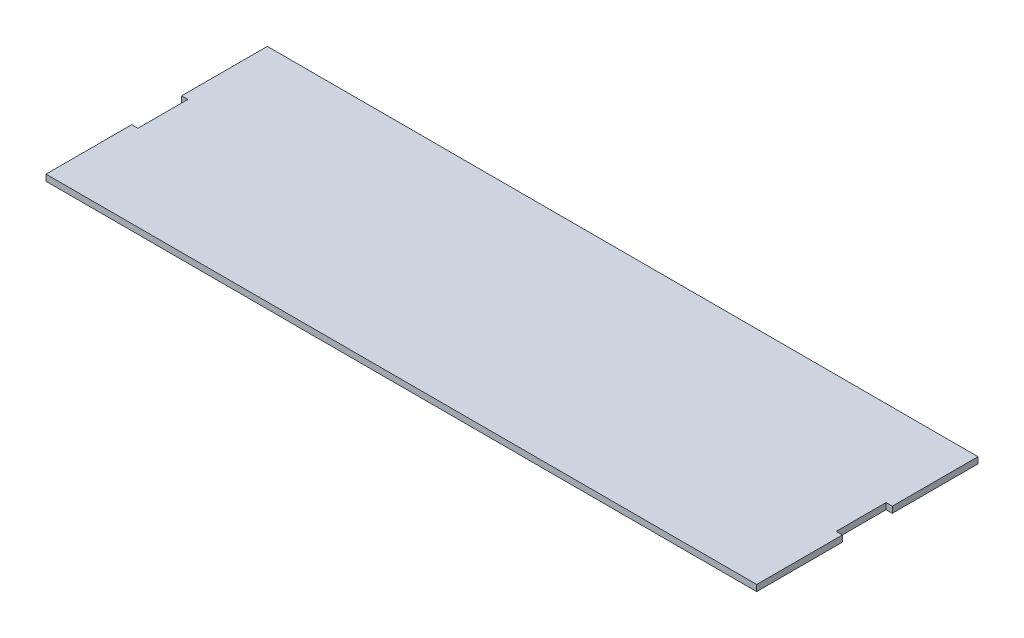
ISO-10303-21;
HEADER;
FILE_DESCRIPTION(('STEP AP214'),'2;1');
FILE_NAME('part.step','',(''),(''),'','','');
FILE_SCHEMA(('AUTOMOTIVE_DESIGN { 1 0 10303 214 1 1 1 1 }'));
ENDSEC;
DATA;
#1=APPLICATION_CONTEXT('core data for automotive mechanical design processes');
#2=APPLICATION_PROTOCOL_DEFINITION('international standard','automotive_design',2000,#1);
#3=PRODUCT_CONTEXT('',#1,'mechanical');
#4=PRODUCT('Part','Part','',(#3));
#5=PRODUCT_RELATED_PRODUCT_CATEGORY('part','',(#4));
#6=PRODUCT_DEFINITION_FORMATION('','',#4);
#7=PRODUCT_DEFINITION_CONTEXT('part definition',#1,'design');
#8=PRODUCT_DEFINITION('design','',#6,#7);
#9=PRODUCT_DEFINITION_SHAPE('','',#8);
#10=(LENGTH_UNIT() NAMED_UNIT(*) SI_UNIT(.MILLI.,.METRE.));
#11=(NAMED_UNIT(*) PLANE_ANGLE_UNIT() SI_UNIT($,.RADIAN.));
#12=(NAMED_UNIT(*) SI_UNIT($,.STERADIAN.) SOLID_ANGLE_UNIT());
#13=UNCERTAINTY_MEASURE_WITH_UNIT(LENGTH_MEASURE(1.E-05),#10,'distance_accuracy_value','');
#14=(GEOMETRIC_REPRESENTATION_CONTEXT(3) GLOBAL_UNCERTAINTY_ASSIGNED_CONTEXT((#13)) GLOBAL_UNIT_ASSIGNED_CONTEXT((#10,
#11,#12)) REPRESENTATION_CONTEXT('',''));
#15=CARTESIAN_POINT('',(0.,0.,0.));
#16=DIRECTION('',(0.,0.,1.));
#17=DIRECTION('',(1.,0.,0.));
#18=AXIS2_PLACEMENT_3D('',#15,#16,#17);
#19=CARTESIAN_POINT('',(-114.,2.,-35.5));
#20=DIRECTION('',(1.,0.,0.));
#21=DIRECTION('',(0.,0.,-1.));
#22=AXIS2_PLACEMENT_3D('',#19,#20,#21);
#23=PLANE('',#22);
#24=DIRECTION('',(0.,0.,1.));
#25=VECTOR('',#24,1.);
#26=CARTESIAN_POINT('',(-114.,2.,-35.5));
#27=LINE('',#26,#25);
#28=CARTESIAN_POINT('',(-114.,2.,8.));
#29=VERTEX_POINT('',#28);
#30=CARTESIAN_POINT('',(-114.,2.,35.5));
#31=VERTEX_POINT('',#30);
#32=EDGE_CURVE('E188',#29,#31,#27,.T.);
#33=ORIENTED_EDGE('',*,*,#32,.F.);
#34=DIRECTION('',(0.,-1.,0.));
#35=VECTOR('',#34,1.);
#36=CARTESIAN_POINT('',(-114.,2.,8.));
#37=LINE('',#36,#35);
#38=CARTESIAN_POINT('',(-114.,0.,8.));
#39=VERTEX_POINT('',#38);
#40=EDGE_CURVE('E152',#29,#39,#37,.T.);
#41=ORIENTED_EDGE('',*,*,#40,.T.);
#42=DIRECTION('',(0.,0.,1.));
#43=VECTOR('',#42,1.);
#44=CARTESIAN_POINT('',(-114.,0.,-35.5));
#45=LINE('',#44,#43);
#46=CARTESIAN_POINT('',(-114.,0.,35.5));
#47=VERTEX_POINT('',#46);
#48=EDGE_CURVE('E176',#39,#47,#45,.T.);
#49=ORIENTED_EDGE('',*,*,#48,.T.);
#50=DIRECTION('',(0.,-1.,0.));
#51=VECTOR('',#50,1.);
#52=CARTESIAN_POINT('',(-114.,2.,35.5));
#53=LINE('',#52,#51);
#54=EDGE_CURVE('E207',#31,#47,#53,.T.);
#55=ORIENTED_EDGE('',*,*,#54,.F.);
#56=EDGE_LOOP('',(#33,#41,#49,#55));
#57=FACE_BOUND('',#56,.T.);
#58=ADVANCED_FACE('F33',(#57),#23,.F.);
#59=CARTESIAN_POINT('',(114.,2.,-35.5));
#60=DIRECTION('',(-1.,0.,0.));
#61=DIRECTION('',(0.,0.,1.));
#62=AXIS2_PLACEMENT_3D('',#59,#60,#61);
#63=PLANE('',#62);
#64=DIRECTION('',(0.,0.,-1.));
#65=VECTOR('',#64,1.);
#66=CARTESIAN_POINT('',(114.,0.,-35.5));
#67=LINE('',#66,#65);
#68=CARTESIAN_POINT('',(114.,0.,35.5));
#69=VERTEX_POINT('',#68);
#70=CARTESIAN_POINT('',(114.,0.,8.));
#71=VERTEX_POINT('',#70);
#72=EDGE_CURVE('E183',#69,#71,#67,.T.);
#73=ORIENTED_EDGE('',*,*,#72,.T.);
#74=DIRECTION('',(0.,1.,0.));
#75=VECTOR('',#74,1.);
#76=CARTESIAN_POINT('',(114.,2.,8.));
#77=LINE('',#76,#75);
#78=CARTESIAN_POINT('',(114.,2.,8.));
#79=VERTEX_POINT('',#78);
#80=EDGE_CURVE('E173',#71,#79,#77,.T.);
#81=ORIENTED_EDGE('',*,*,#80,.T.);
#82=DIRECTION('',(0.,0.,-1.));
#83=VECTOR('',#82,1.);
#84=CARTESIAN_POINT('',(114.,2.,-35.5));
#85=LINE('',#84,#83);
#86=CARTESIAN_POINT('',(114.,2.,35.5));
#87=VERTEX_POINT('',#86);
#88=EDGE_CURVE('E193',#87,#79,#85,.T.);
#89=ORIENTED_EDGE('',*,*,#88,.F.);
#90=DIRECTION('',(0.,-1.,0.));
#91=VECTOR('',#90,1.);
#92=CARTESIAN_POINT('',(114.,2.,35.5));
#93=LINE('',#92,#91);
#94=EDGE_CURVE('E204',#87,#69,#93,.T.);
#95=ORIENTED_EDGE('',*,*,#94,.T.);
#96=EDGE_LOOP('',(#73,#81,#89,#95));
#97=FACE_BOUND('',#96,.T.);
#98=ADVANCED_FACE('F232',(#97),#63,.F.);
#99=CARTESIAN_POINT('',(-114.,0.,-35.5));
#100=VERTEX_POINT('',#99);
#101=CARTESIAN_POINT('',(-114.,0.,-8.));
#102=VERTEX_POINT('',#101);
#103=EDGE_CURVE('E177',#100,#102,#45,.T.);
#104=ORIENTED_EDGE('',*,*,#103,.T.);
#105=DIRECTION('',(0.,1.,0.));
#106=VECTOR('',#105,1.);
#107=CARTESIAN_POINT('',(-114.,2.,-8.));
#108=LINE('',#107,#106);
#109=CARTESIAN_POINT('',(-114.,2.,-8.));
#110=VERTEX_POINT('',#109);
#111=EDGE_CURVE('E48',#102,#110,#108,.T.);
#112=ORIENTED_EDGE('',*,*,#111,.T.);
#113=CARTESIAN_POINT('',(-114.,2.,-35.5));
#114=VERTEX_POINT('',#113);
#115=EDGE_CURVE('E142',#114,#110,#27,.T.);
#116=ORIENTED_EDGE('',*,*,#115,.F.);
#117=DIRECTION('',(0.,-1.,0.));
#118=VECTOR('',#117,1.);
#119=CARTESIAN_POINT('',(-114.,2.,-35.5));
#120=LINE('',#119,#118);
#121=EDGE_CURVE('E198',#114,#100,#120,.T.);
#122=ORIENTED_EDGE('',*,*,#121,.T.);
#123=EDGE_LOOP('',(#104,#112,#116,#122));
#124=FACE_BOUND('',#123,.T.);
#125=ADVANCED_FACE('F35',(#124),#23,.F.);
#126=CARTESIAN_POINT('',(-114.,2.,35.5));
#127=DIRECTION('',(0.,0.,-1.));
#128=DIRECTION('',(-1.,0.,0.));
#129=AXIS2_PLACEMENT_3D('',#126,#127,#128);
#130=PLANE('',#129);
#131=DIRECTION('',(1.,0.,0.));
#132=VECTOR('',#131,1.);
#133=CARTESIAN_POINT('',(-114.,0.,35.5));
#134=LINE('',#133,#132);
#135=EDGE_CURVE('E180',#47,#69,#134,.T.);
#136=ORIENTED_EDGE('',*,*,#135,.T.);
#137=ORIENTED_EDGE('',*,*,#94,.F.);
#138=DIRECTION('',(1.,0.,0.));
#139=VECTOR('',#138,1.);
#140=CARTESIAN_POINT('',(-114.,2.,35.5));
#141=LINE('',#140,#139);
#142=EDGE_CURVE('E190',#31,#87,#141,.T.);
#143=ORIENTED_EDGE('',*,*,#142,.F.);
#144=ORIENTED_EDGE('',*,*,#54,.T.);
#145=EDGE_LOOP('',(#136,#137,#143,#144));
#146=FACE_BOUND('',#145,.T.);
#147=ADVANCED_FACE('F239',(#146),#130,.F.);
#148=CARTESIAN_POINT('',(114.,2.,-8.));
#149=VERTEX_POINT('',#148);
#150=CARTESIAN_POINT('',(114.,2.,-35.5));
#151=VERTEX_POINT('',#150);
#152=EDGE_CURVE('E192',#149,#151,#85,.T.);
#153=ORIENTED_EDGE('',*,*,#152,.F.);
#154=DIRECTION('',(0.,-1.,0.));
#155=VECTOR('',#154,1.);
#156=CARTESIAN_POINT('',(114.,2.,-8.));
#157=LINE('',#156,#155);
#158=CARTESIAN_POINT('',(114.,0.,-8.));
#159=VERTEX_POINT('',#158);
#160=EDGE_CURVE('E169',#149,#159,#157,.T.);
#161=ORIENTED_EDGE('',*,*,#160,.T.);
#162=CARTESIAN_POINT('',(114.,0.,-35.5));
#163=VERTEX_POINT('',#162);
#164=EDGE_CURVE('E182',#159,#163,#67,.T.);
#165=ORIENTED_EDGE('',*,*,#164,.T.);
#166=DIRECTION('',(0.,-1.,0.));
#167=VECTOR('',#166,1.);
#168=CARTESIAN_POINT('',(114.,2.,-35.5));
#169=LINE('',#168,#167);
#170=EDGE_CURVE('E201',#151,#163,#169,.T.);
#171=ORIENTED_EDGE('',*,*,#170,.F.);
#172=EDGE_LOOP('',(#153,#161,#165,#171));
#173=FACE_BOUND('',#172,.T.);
#174=ADVANCED_FACE('F220',(#173),#63,.F.);
#175=CARTESIAN_POINT('',(-114.,2.,-35.5));
#176=DIRECTION('',(0.,0.,1.));
#177=DIRECTION('',(1.,0.,0.));
#178=AXIS2_PLACEMENT_3D('',#175,#176,#177);
#179=PLANE('',#178);
#180=DIRECTION('',(-1.,0.,0.));
#181=VECTOR('',#180,1.);
#182=CARTESIAN_POINT('',(-114.,0.,-35.5));
#183=LINE('',#182,#181);
#184=EDGE_CURVE('E186',#163,#100,#183,.T.);
#185=ORIENTED_EDGE('',*,*,#184,.T.);
#186=ORIENTED_EDGE('',*,*,#121,.F.);
#187=DIRECTION('',(-1.,0.,0.));
#188=VECTOR('',#187,1.);
#189=CARTESIAN_POINT('',(-114.,2.,-35.5));
#190=LINE('',#189,#188);
#191=EDGE_CURVE('E196',#151,#114,#190,.T.);
#192=ORIENTED_EDGE('',*,*,#191,.F.);
#193=ORIENTED_EDGE('',*,*,#170,.T.);
#194=EDGE_LOOP('',(#185,#186,#192,#193));
#195=FACE_BOUND('',#194,.T.);
#196=ADVANCED_FACE('F247',(#195),#179,.F.);
#197=CARTESIAN_POINT('',(-114.,2.,35.5));
#198=DIRECTION('',(0.,1.,0.));
#199=DIRECTION('',(0.,0.,1.));
#200=AXIS2_PLACEMENT_3D('',#197,#198,#199);
#201=PLANE('',#200);
#202=DIRECTION('',(1.,0.,0.));
#203=VECTOR('',#202,1.);
#204=CARTESIAN_POINT('',(-112.,2.,8.));
#205=LINE('',#204,#203);
#206=CARTESIAN_POINT('',(-112.,2.,8.));
#207=VERTEX_POINT('',#206);
#208=EDGE_CURVE('E143',#29,#207,#205,.T.);
#209=ORIENTED_EDGE('',*,*,#208,.F.);
#210=ORIENTED_EDGE('',*,*,#32,.T.);
#211=ORIENTED_EDGE('',*,*,#142,.T.);
#212=ORIENTED_EDGE('',*,*,#88,.T.);
#213=DIRECTION('',(1.,0.,0.));
#214=VECTOR('',#213,1.);
#215=CARTESIAN_POINT('',(123.02396514,2.,8.));
#216=LINE('',#215,#214);
#217=CARTESIAN_POINT('',(112.,2.,8.));
#218=VERTEX_POINT('',#217);
#219=EDGE_CURVE('E160',#218,#79,#216,.T.);
#220=ORIENTED_EDGE('',*,*,#219,.F.);
#221=DIRECTION('',(0.,0.,1.));
#222=VECTOR('',#221,1.);
#223=CARTESIAN_POINT('',(112.,2.,-8.));
#224=LINE('',#223,#222);
#225=CARTESIAN_POINT('',(112.,2.,-8.));
#226=VERTEX_POINT('',#225);
#227=EDGE_CURVE('E157',#226,#218,#224,.T.);
#228=ORIENTED_EDGE('',*,*,#227,.F.);
#229=DIRECTION('',(-1.,0.,0.));
#230=VECTOR('',#229,1.);
#231=CARTESIAN_POINT('',(123.02396514,2.,-8.));
#232=LINE('',#231,#230);
#233=EDGE_CURVE('E155',#149,#226,#232,.T.);
#234=ORIENTED_EDGE('',*,*,#233,.F.);
#235=ORIENTED_EDGE('',*,*,#152,.T.);
#236=ORIENTED_EDGE('',*,*,#191,.T.);
#237=ORIENTED_EDGE('',*,*,#115,.T.);
#238=DIRECTION('',(-1.,0.,0.));
#239=VECTOR('',#238,1.);
#240=CARTESIAN_POINT('',(-112.,2.,-8.));
#241=LINE('',#240,#239);
#242=CARTESIAN_POINT('',(-112.,2.,-8.));
#243=VERTEX_POINT('',#242);
#244=EDGE_CURVE('E125',#243,#110,#241,.T.);
#245=ORIENTED_EDGE('',*,*,#244,.F.);
#246=DIRECTION('',(0.,0.,-1.));
#247=VECTOR('',#246,1.);
#248=CARTESIAN_POINT('',(-112.,2.,-8.));
#249=LINE('',#248,#247);
#250=EDGE_CURVE('E134',#207,#243,#249,.T.);
#251=ORIENTED_EDGE('',*,*,#250,.F.);
#252=EDGE_LOOP('',(#209,#210,#211,#212,#220,#228,#234,#235,#236,#237,#245,#251));
#253=FACE_BOUND('',#252,.T.);
#254=ADVANCED_FACE('F140',(#253),#201,.T.);
#255=CARTESIAN_POINT('',(-114.,0.,35.5));
#256=DIRECTION('',(0.,1.,0.));
#257=DIRECTION('',(0.,0.,1.));
#258=AXIS2_PLACEMENT_3D('',#255,#256,#257);
#259=PLANE('',#258);
#260=ORIENTED_EDGE('',*,*,#48,.F.);
#261=DIRECTION('',(1.,0.,0.));
#262=VECTOR('',#261,1.);
#263=CARTESIAN_POINT('',(-114.,0.,8.));
#264=LINE('',#263,#262);
#265=CARTESIAN_POINT('',(-112.,0.,8.));
#266=VERTEX_POINT('',#265);
#267=EDGE_CURVE('E11',#39,#266,#264,.T.);
#268=ORIENTED_EDGE('',*,*,#267,.T.);
#269=DIRECTION('',(0.,0.,-1.));
#270=VECTOR('',#269,1.);
#271=CARTESIAN_POINT('',(-112.,0.,-8.));
#272=LINE('',#271,#270);
#273=CARTESIAN_POINT('',(-112.,0.,-8.));
#274=VERTEX_POINT('',#273);
#275=EDGE_CURVE('E145',#266,#274,#272,.T.);
#276=ORIENTED_EDGE('',*,*,#275,.T.);
#277=DIRECTION('',(-1.,0.,0.));
#278=VECTOR('',#277,1.);
#279=CARTESIAN_POINT('',(-112.,0.,-8.));
#280=LINE('',#279,#278);
#281=EDGE_CURVE('E126',#274,#102,#280,.T.);
#282=ORIENTED_EDGE('',*,*,#281,.T.);
#283=ORIENTED_EDGE('',*,*,#103,.F.);
#284=ORIENTED_EDGE('',*,*,#184,.F.);
#285=ORIENTED_EDGE('',*,*,#164,.F.);
#286=DIRECTION('',(-1.,0.,0.));
#287=VECTOR('',#286,1.);
#288=CARTESIAN_POINT('',(-114.,0.,-8.));
#289=LINE('',#288,#287);
#290=CARTESIAN_POINT('',(112.,0.,-8.));
#291=VERTEX_POINT('',#290);
#292=EDGE_CURVE('E41',#159,#291,#289,.T.);
#293=ORIENTED_EDGE('',*,*,#292,.T.);
#294=DIRECTION('',(0.,0.,1.));
#295=VECTOR('',#294,1.);
#296=CARTESIAN_POINT('',(112.,0.,-8.));
#297=LINE('',#296,#295);
#298=CARTESIAN_POINT('',(112.,0.,8.));
#299=VERTEX_POINT('',#298);
#300=EDGE_CURVE('E56',#291,#299,#297,.T.);
#301=ORIENTED_EDGE('',*,*,#300,.T.);
#302=DIRECTION('',(1.,0.,0.));
#303=VECTOR('',#302,1.);
#304=CARTESIAN_POINT('',(123.02396514,0.,8.));
#305=LINE('',#304,#303);
#306=EDGE_CURVE('E163',#299,#71,#305,.T.);
#307=ORIENTED_EDGE('',*,*,#306,.T.);
#308=ORIENTED_EDGE('',*,*,#72,.F.);
#309=ORIENTED_EDGE('',*,*,#135,.F.);
#310=EDGE_LOOP('',(#260,#268,#276,#282,#283,#284,#285,#293,#301,#307,#308,#309));
#311=FACE_BOUND('',#310,.T.);
#312=ADVANCED_FACE('F213',(#311),#259,.F.);
#313=CARTESIAN_POINT('',(123.02396514,0.,8.));
#314=DIRECTION('',(0.,0.,1.));
#315=DIRECTION('',(1.,0.,0.));
#316=AXIS2_PLACEMENT_3D('',#313,#314,#315);
#317=PLANE('',#316);
#318=ORIENTED_EDGE('',*,*,#306,.F.);
#319=DIRECTION('',(0.,1.,0.));
#320=VECTOR('',#319,1.);
#321=CARTESIAN_POINT('',(112.,0.,8.));
#322=LINE('',#321,#320);
#323=EDGE_CURVE('E167',#299,#218,#322,.T.);
#324=ORIENTED_EDGE('',*,*,#323,.T.);
#325=ORIENTED_EDGE('',*,*,#219,.T.);
#326=ORIENTED_EDGE('',*,*,#80,.F.);
#327=EDGE_LOOP('',(#318,#324,#325,#326));
#328=FACE_BOUND('',#327,.T.);
#329=ADVANCED_FACE('F230',(#328),#317,.F.);
#330=CARTESIAN_POINT('',(123.02396514,0.,-8.));
#331=DIRECTION('',(0.,0.,-1.));
#332=DIRECTION('',(-1.,0.,0.));
#333=AXIS2_PLACEMENT_3D('',#330,#331,#332);
#334=PLANE('',#333);
#335=ORIENTED_EDGE('',*,*,#233,.T.);
#336=DIRECTION('',(0.,1.,0.));
#337=VECTOR('',#336,1.);
#338=CARTESIAN_POINT('',(112.,0.,-8.));
#339=LINE('',#338,#337);
#340=EDGE_CURVE('E166',#291,#226,#339,.T.);
#341=ORIENTED_EDGE('',*,*,#340,.F.);
#342=ORIENTED_EDGE('',*,*,#292,.F.);
#343=ORIENTED_EDGE('',*,*,#160,.F.);
#344=EDGE_LOOP('',(#335,#341,#342,#343));
#345=FACE_BOUND('',#344,.T.);
#346=ADVANCED_FACE('F216',(#345),#334,.F.);
#347=CARTESIAN_POINT('',(112.,0.,-8.));
#348=DIRECTION('',(-1.,0.,0.));
#349=DIRECTION('',(0.,0.,1.));
#350=AXIS2_PLACEMENT_3D('',#347,#348,#349);
#351=PLANE('',#350);
#352=ORIENTED_EDGE('',*,*,#227,.T.);
#353=ORIENTED_EDGE('',*,*,#323,.F.);
#354=ORIENTED_EDGE('',*,*,#300,.F.);
#355=ORIENTED_EDGE('',*,*,#340,.T.);
#356=EDGE_LOOP('',(#352,#353,#354,#355));
#357=FACE_BOUND('',#356,.T.);
#358=ADVANCED_FACE('F226',(#357),#351,.F.);
#359=CARTESIAN_POINT('',(-112.,0.,8.));
#360=DIRECTION('',(0.,0.,1.));
#361=DIRECTION('',(1.,0.,0.));
#362=AXIS2_PLACEMENT_3D('',#359,#360,#361);
#363=PLANE('',#362);
#364=ORIENTED_EDGE('',*,*,#208,.T.);
#365=DIRECTION('',(0.,1.,0.));
#366=VECTOR('',#365,1.);
#367=CARTESIAN_POINT('',(-112.,0.,8.));
#368=LINE('',#367,#366);
#369=EDGE_CURVE('E130',#266,#207,#368,.T.);
#370=ORIENTED_EDGE('',*,*,#369,.F.);
#371=ORIENTED_EDGE('',*,*,#267,.F.);
#372=ORIENTED_EDGE('',*,*,#40,.F.);
#373=EDGE_LOOP('',(#364,#370,#371,#372));
#374=FACE_BOUND('',#373,.T.);
#375=ADVANCED_FACE('F243',(#374),#363,.F.);
#376=CARTESIAN_POINT('',(-112.,0.,-8.));
#377=DIRECTION('',(0.,0.,-1.));
#378=DIRECTION('',(-1.,0.,0.));
#379=AXIS2_PLACEMENT_3D('',#376,#377,#378);
#380=PLANE('',#379);
#381=ORIENTED_EDGE('',*,*,#281,.F.);
#382=DIRECTION('',(0.,1.,0.));
#383=VECTOR('',#382,1.);
#384=CARTESIAN_POINT('',(-112.,0.,-8.));
#385=LINE('',#384,#383);
#386=EDGE_CURVE('E121',#274,#243,#385,.T.);
#387=ORIENTED_EDGE('',*,*,#386,.T.);
#388=ORIENTED_EDGE('',*,*,#244,.T.);
#389=ORIENTED_EDGE('',*,*,#111,.F.);
#390=EDGE_LOOP('',(#381,#387,#388,#389));
#391=FACE_BOUND('',#390,.T.);
#392=ADVANCED_FACE('F123',(#391),#380,.F.);
#393=CARTESIAN_POINT('',(-112.,0.,-8.));
#394=DIRECTION('',(1.,0.,0.));
#395=DIRECTION('',(0.,0.,-1.));
#396=AXIS2_PLACEMENT_3D('',#393,#394,#395);
#397=PLANE('',#396);
#398=ORIENTED_EDGE('',*,*,#250,.T.);
#399=ORIENTED_EDGE('',*,*,#386,.F.);
#400=ORIENTED_EDGE('',*,*,#275,.F.);
#401=ORIENTED_EDGE('',*,*,#369,.T.);
#402=EDGE_LOOP('',(#398,#399,#400,#401));
#403=FACE_BOUND('',#402,.T.);
#404=ADVANCED_FACE('F135',(#403),#397,.F.);
#405=CLOSED_SHELL('',(#58,#98,#125,#147,#174,#196,#254,#312,#329,#346,#358,#375,#392,#404));
#406=MANIFOLD_SOLID_BREP('B2',#405);
#407=ADVANCED_BREP_SHAPE_REPRESENTATION('',(#18,#406),#14);
#408=SHAPE_DEFINITION_REPRESENTATION(#9,#407);
ENDSEC;
END-ISO-10303-21;
